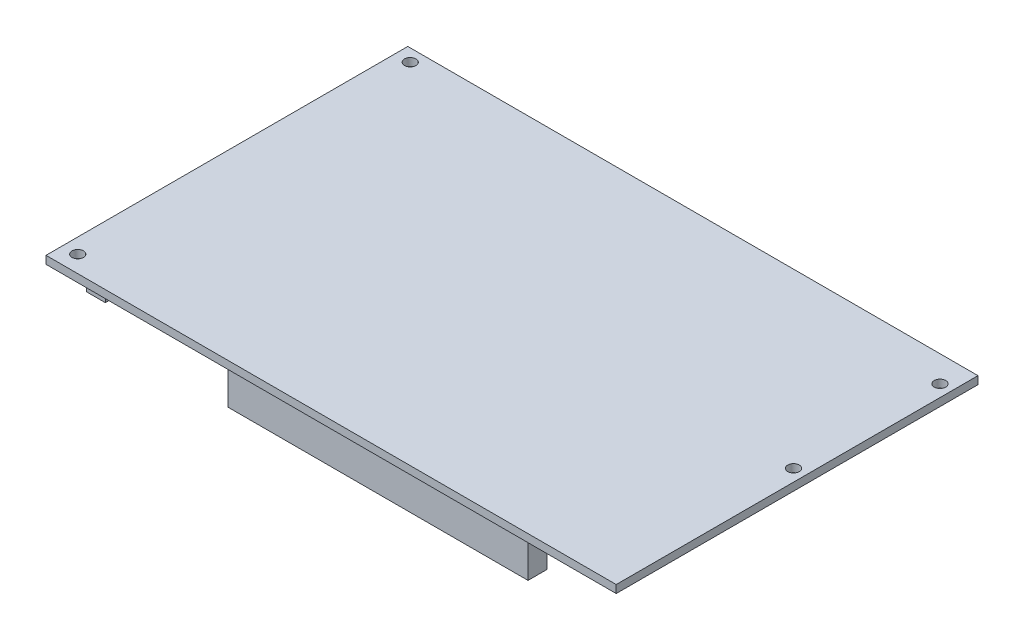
from build123d import *

# Parameters (mm, degrees)
SKETCH1_W      = 145.9357
SKETCH1_H      = 92.5957
SKETCH1_R      = 1.4732
EXTRUDE1_DEPTH = 2.0066
SKETCH3_W      = 76.7588
SKETCH3_H      = 4.8387
SKETCH3_W_2    = 4.8387
SKETCH3_H_2    = 75.9714
EXTRUDE3_DEPTH = 9.7663


with BuildPart() as part:
    # Sketch1 → Extrude1 (new body)
    with BuildSketch(Plane(origin=(0, 0, 0), x_dir=(1, 0, 0), z_dir=(0, 1, 0))):
        with Locations((72.96785, 46.29785)):
            Rectangle(SKETCH1_W, SKETCH1_H)
        with Locations(Location((3.81, 89.408, 0), (0, 0, 270))):
            Circle(SKETCH1_R, mode=Mode.SUBTRACT)
        with Locations(Location((3.81, 4.318, 0), (0, 0, 270))):
            Circle(SKETCH1_R, mode=Mode.SUBTRACT)
        with Locations(Location((142.875, 85.9155, 0), (0, 0, 270))):
            Circle(SKETCH1_R, mode=Mode.SUBTRACT)
        with Locations(Location((142.875, 48.4505, 0), (0, 0, 270))):
            Circle(SKETCH1_R, mode=Mode.SUBTRACT)
    extrude(amount=EXTRUDE1_DEPTH)

    # Sketch3 → Extrude3 (add)
    with BuildSketch(Plane.XZ):
        with Locations((83.5914, -3.81635)):
            Rectangle(SKETCH3_W, SKETCH3_H)
        with Locations((3.89255, -46.8503)):
            Rectangle(SKETCH3_W_2, SKETCH3_H_2)
    extrude(amount=EXTRUDE3_DEPTH)


solid = part.part
